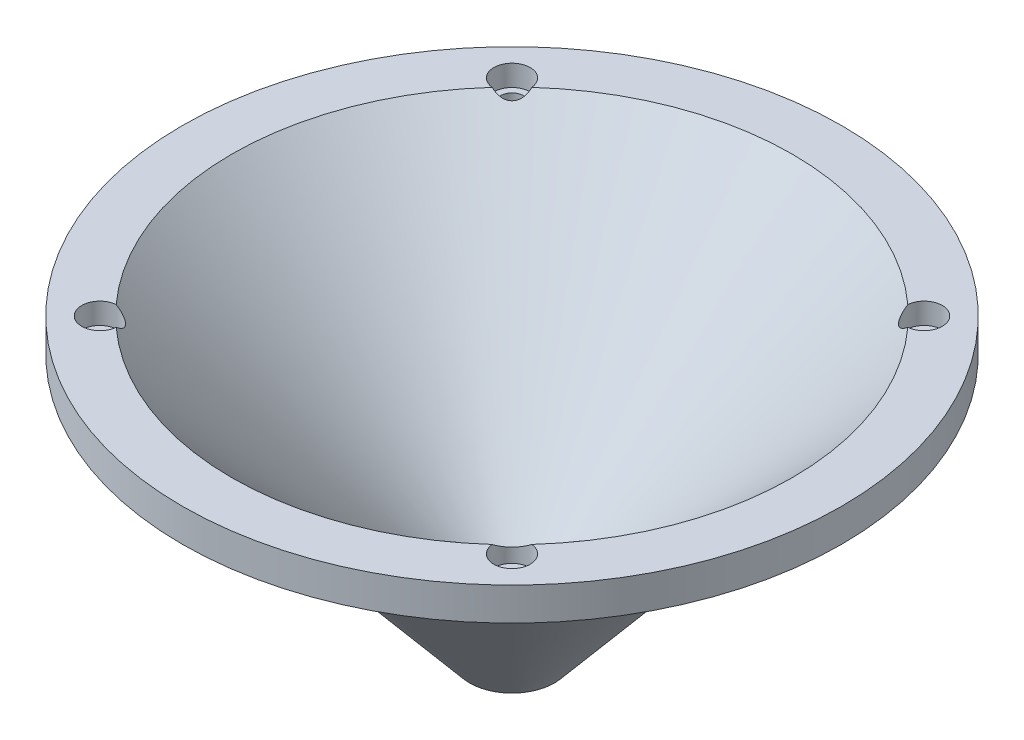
ISO-10303-21;
HEADER;
FILE_DESCRIPTION(('STEP AP214'),'2;1');
FILE_NAME('part.step','',(''),(''),'','','');
FILE_SCHEMA(('AUTOMOTIVE_DESIGN { 1 0 10303 214 1 1 1 1 }'));
ENDSEC;
DATA;
#1=APPLICATION_CONTEXT('core data for automotive mechanical design processes');
#2=APPLICATION_PROTOCOL_DEFINITION('international standard','automotive_design',2000,#1);
#3=PRODUCT_CONTEXT('',#1,'mechanical');
#4=PRODUCT('Part','Part','',(#3));
#5=PRODUCT_RELATED_PRODUCT_CATEGORY('part','',(#4));
#6=PRODUCT_DEFINITION_FORMATION('','',#4);
#7=PRODUCT_DEFINITION_CONTEXT('part definition',#1,'design');
#8=PRODUCT_DEFINITION('design','',#6,#7);
#9=PRODUCT_DEFINITION_SHAPE('','',#8);
#10=(LENGTH_UNIT() NAMED_UNIT(*) SI_UNIT(.MILLI.,.METRE.));
#11=(NAMED_UNIT(*) PLANE_ANGLE_UNIT() SI_UNIT($,.RADIAN.));
#12=(NAMED_UNIT(*) SI_UNIT($,.STERADIAN.) SOLID_ANGLE_UNIT());
#13=UNCERTAINTY_MEASURE_WITH_UNIT(LENGTH_MEASURE(1.E-05),#10,'distance_accuracy_value','');
#14=(GEOMETRIC_REPRESENTATION_CONTEXT(3) GLOBAL_UNCERTAINTY_ASSIGNED_CONTEXT((#13)) GLOBAL_UNIT_ASSIGNED_CONTEXT((#10,
#11,#12)) REPRESENTATION_CONTEXT('',''));
#15=CARTESIAN_POINT('',(0.,0.,0.));
#16=DIRECTION('',(0.,0.,1.));
#17=DIRECTION('',(1.,0.,0.));
#18=AXIS2_PLACEMENT_3D('',#15,#16,#17);
#19=CARTESIAN_POINT('',(0.,-10.,0.));
#20=DIRECTION('',(0.,1.,0.));
#21=DIRECTION('',(0.,0.,1.));
#22=AXIS2_PLACEMENT_3D('',#19,#20,#21);
#23=PLANE('',#22);
#24=CARTESIAN_POINT('',(62.5,-10.,62.5));
#25=DIRECTION('',(0.,1.,0.));
#26=DIRECTION('',(0.,0.,1.));
#27=AXIS2_PLACEMENT_3D('',#24,#25,#26);
#28=CIRCLE('',#27,3.49999999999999);
#29=CARTESIAN_POINT('',(62.5,-10.,66.));
#30=VERTEX_POINT('',#29);
#31=EDGE_CURVE('E165',#30,#30,#28,.T.);
#32=ORIENTED_EDGE('',*,*,#31,.T.);
#33=EDGE_LOOP('',(#32));
#34=FACE_BOUND('',#33,.T.);
#35=CARTESIAN_POINT('',(-62.5,-10.,62.5));
#36=DIRECTION('',(0.,1.,0.));
#37=DIRECTION('',(0.,0.,1.));
#38=AXIS2_PLACEMENT_3D('',#35,#36,#37);
#39=CIRCLE('',#38,3.49999999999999);
#40=CARTESIAN_POINT('',(-62.5,-10.,66.));
#41=VERTEX_POINT('',#40);
#42=EDGE_CURVE('E156',#41,#41,#39,.T.);
#43=ORIENTED_EDGE('',*,*,#42,.T.);
#44=EDGE_LOOP('',(#43));
#45=FACE_BOUND('',#44,.T.);
#46=CARTESIAN_POINT('',(-62.5,-10.,-62.5));
#47=DIRECTION('',(0.,1.,0.));
#48=DIRECTION('',(0.,0.,1.));
#49=AXIS2_PLACEMENT_3D('',#46,#47,#48);
#50=CIRCLE('',#49,3.49999999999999);
#51=CARTESIAN_POINT('',(-62.5,-10.,-59.));
#52=VERTEX_POINT('',#51);
#53=EDGE_CURVE('E173',#52,#52,#50,.T.);
#54=ORIENTED_EDGE('',*,*,#53,.T.);
#55=EDGE_LOOP('',(#54));
#56=FACE_BOUND('',#55,.T.);
#57=CARTESIAN_POINT('',(62.5,-10.,-62.5));
#58=DIRECTION('',(0.,1.,0.));
#59=DIRECTION('',(0.,0.,1.));
#60=AXIS2_PLACEMENT_3D('',#57,#58,#59);
#61=CIRCLE('',#60,3.49999999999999);
#62=CARTESIAN_POINT('',(62.5,-10.,-59.));
#63=VERTEX_POINT('',#62);
#64=EDGE_CURVE('E177',#63,#63,#61,.T.);
#65=ORIENTED_EDGE('',*,*,#64,.T.);
#66=EDGE_LOOP('',(#65));
#67=FACE_BOUND('',#66,.T.);
#68=CARTESIAN_POINT('',(0.,-10.,0.));
#69=DIRECTION('',(0.,1.,0.));
#70=DIRECTION('',(0.,0.,1.));
#71=AXIS2_PLACEMENT_3D('',#68,#69,#70);
#72=CIRCLE('',#71,100.);
#73=CARTESIAN_POINT('',(0.,-10.,100.));
#74=VERTEX_POINT('',#73);
#75=EDGE_CURVE('E184',#74,#74,#72,.T.);
#76=ORIENTED_EDGE('',*,*,#75,.F.);
#77=EDGE_LOOP('',(#76));
#78=FACE_BOUND('',#77,.T.);
#79=CARTESIAN_POINT('',(0.,-9.99999999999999,0.));
#80=DIRECTION('',(0.,1.,0.));
#81=DIRECTION('',(0.,0.,1.));
#82=AXIS2_PLACEMENT_3D('',#79,#80,#81);
#83=CIRCLE('',#82,80.);
#84=CARTESIAN_POINT('',(0.,-10.,79.9999999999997));
#85=VERTEX_POINT('',#84);
#86=EDGE_CURVE('E164',#85,#85,#83,.F.);
#87=ORIENTED_EDGE('',*,*,#86,.F.);
#88=EDGE_LOOP('',(#87));
#89=FACE_BOUND('',#88,.T.);
#90=ADVANCED_FACE('F35',(#34,#45,#56,#67,#78,#89),#23,.F.);
#91=CARTESIAN_POINT('',(0.,-10.,0.));
#92=DIRECTION('',(0.,1.,0.));
#93=DIRECTION('',(0.,0.,1.));
#94=AXIS2_PLACEMENT_3D('',#91,#92,#93);
#95=CYLINDRICAL_SURFACE('',#94,100.);
#96=ORIENTED_EDGE('',*,*,#75,.T.);
#97=EDGE_LOOP('',(#96));
#98=FACE_BOUND('',#97,.T.);
#99=CARTESIAN_POINT('',(0.,0.,0.));
#100=DIRECTION('',(0.,1.,0.));
#101=DIRECTION('',(0.,0.,1.));
#102=AXIS2_PLACEMENT_3D('',#99,#100,#101);
#103=CIRCLE('',#102,100.);
#104=CARTESIAN_POINT('',(0.,0.,100.));
#105=VERTEX_POINT('',#104);
#106=EDGE_CURVE('E185',#105,#105,#103,.T.);
#107=ORIENTED_EDGE('',*,*,#106,.F.);
#108=EDGE_LOOP('',(#107));
#109=FACE_BOUND('',#108,.T.);
#110=ADVANCED_FACE('F220',(#98,#109),#95,.T.);
#111=CARTESIAN_POINT('',(0.,0.,0.));
#112=DIRECTION('',(0.,1.,0.));
#113=DIRECTION('',(0.,0.,1.));
#114=AXIS2_PLACEMENT_3D('',#111,#112,#113);
#115=PLANE('',#114);
#116=CARTESIAN_POINT('',(-62.5,0.,-62.5));
#117=DIRECTION('',(0.,1.,0.));
#118=DIRECTION('',(0.,0.,1.));
#119=AXIS2_PLACEMENT_3D('',#116,#117,#118);
#120=CIRCLE('',#119,5.49999999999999);
#121=CARTESIAN_POINT('',(-57.0258085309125,0.,-63.0321914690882));
#122=VERTEX_POINT('',#121);
#123=CARTESIAN_POINT('',(-63.0321914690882,0.,-57.0258085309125));
#124=VERTEX_POINT('',#123);
#125=EDGE_CURVE('E151',#122,#124,#120,.T.);
#126=ORIENTED_EDGE('',*,*,#125,.F.);
#127=CARTESIAN_POINT('',(0.,0.,0.));
#128=DIRECTION('',(0.,1.,0.));
#129=DIRECTION('',(0.,0.,1.));
#130=AXIS2_PLACEMENT_3D('',#127,#128,#129);
#131=CIRCLE('',#130,85.0000000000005);
#132=CARTESIAN_POINT('',(57.0258085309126,0.,-63.0321914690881));
#133=VERTEX_POINT('',#132);
#134=EDGE_CURVE('E84',#122,#133,#131,.F.);
#135=ORIENTED_EDGE('',*,*,#134,.T.);
#136=CARTESIAN_POINT('',(62.5,0.,-62.5));
#137=DIRECTION('',(0.,1.,0.));
#138=DIRECTION('',(0.,0.,1.));
#139=AXIS2_PLACEMENT_3D('',#136,#137,#138);
#140=CIRCLE('',#139,5.49999999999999);
#141=CARTESIAN_POINT('',(63.0321914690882,0.,-57.0258085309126));
#142=VERTEX_POINT('',#141);
#143=EDGE_CURVE('E82',#142,#133,#140,.T.);
#144=ORIENTED_EDGE('',*,*,#143,.F.);
#145=CARTESIAN_POINT('',(0.,0.,0.));
#146=DIRECTION('',(0.,1.,0.));
#147=DIRECTION('',(0.,0.,1.));
#148=AXIS2_PLACEMENT_3D('',#145,#146,#147);
#149=CIRCLE('',#148,85.0000000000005);
#150=CARTESIAN_POINT('',(63.0321914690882,0.,57.0258085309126));
#151=VERTEX_POINT('',#150);
#152=EDGE_CURVE('E75',#142,#151,#149,.F.);
#153=ORIENTED_EDGE('',*,*,#152,.T.);
#154=CARTESIAN_POINT('',(62.5,0.,62.5));
#155=DIRECTION('',(0.,1.,0.));
#156=DIRECTION('',(0.,0.,1.));
#157=AXIS2_PLACEMENT_3D('',#154,#155,#156);
#158=CIRCLE('',#157,5.49999999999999);
#159=CARTESIAN_POINT('',(57.0258085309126,0.,63.0321914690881));
#160=VERTEX_POINT('',#159);
#161=EDGE_CURVE('E80',#160,#151,#158,.T.);
#162=ORIENTED_EDGE('',*,*,#161,.F.);
#163=CARTESIAN_POINT('',(0.,0.,0.));
#164=DIRECTION('',(0.,1.,0.));
#165=DIRECTION('',(0.,0.,1.));
#166=AXIS2_PLACEMENT_3D('',#163,#164,#165);
#167=CIRCLE('',#166,85.0000000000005);
#168=CARTESIAN_POINT('',(-57.0258085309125,0.,63.0321914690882));
#169=VERTEX_POINT('',#168);
#170=EDGE_CURVE('E85',#160,#169,#167,.F.);
#171=ORIENTED_EDGE('',*,*,#170,.T.);
#172=CARTESIAN_POINT('',(-62.5,0.,62.5));
#173=DIRECTION('',(0.,1.,0.));
#174=DIRECTION('',(0.,0.,1.));
#175=AXIS2_PLACEMENT_3D('',#172,#173,#174);
#176=CIRCLE('',#175,5.49999999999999);
#177=CARTESIAN_POINT('',(-63.0321914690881,0.,57.0258085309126));
#178=VERTEX_POINT('',#177);
#179=EDGE_CURVE('E168',#178,#169,#176,.T.);
#180=ORIENTED_EDGE('',*,*,#179,.F.);
#181=CARTESIAN_POINT('',(0.,0.,0.));
#182=DIRECTION('',(0.,1.,0.));
#183=DIRECTION('',(0.,0.,1.));
#184=AXIS2_PLACEMENT_3D('',#181,#182,#183);
#185=CIRCLE('',#184,85.0000000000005);
#186=EDGE_CURVE('E154',#178,#124,#185,.F.);
#187=ORIENTED_EDGE('',*,*,#186,.T.);
#188=EDGE_LOOP('',(#126,#135,#144,#153,#162,#171,#180,#187));
#189=FACE_BOUND('',#188,.T.);
#190=ORIENTED_EDGE('',*,*,#106,.T.);
#191=EDGE_LOOP('',(#190));
#192=FACE_BOUND('',#191,.T.);
#193=ADVANCED_FACE('F78',(#189,#192),#115,.T.);
#194=CARTESIAN_POINT('',(0.,-90.,0.));
#195=DIRECTION('',(0.,-1.,0.));
#196=DIRECTION('',(0.,0.,-1.));
#197=AXIS2_PLACEMENT_3D('',#194,#195,#196);
#198=PLANE('',#197);
#199=CARTESIAN_POINT('',(0.,-90.,0.));
#200=DIRECTION('',(0.,-1.,0.));
#201=DIRECTION('',(0.,0.,-1.));
#202=AXIS2_PLACEMENT_3D('',#199,#200,#201);
#203=CIRCLE('',#202,12.8720295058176);
#204=CARTESIAN_POINT('',(0.,-90.,12.8720295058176));
#205=VERTEX_POINT('',#204);
#206=EDGE_CURVE('E11',#205,#205,#203,.T.);
#207=ORIENTED_EDGE('',*,*,#206,.T.);
#208=EDGE_LOOP('',(#207));
#209=FACE_BOUND('',#208,.T.);
#210=CARTESIAN_POINT('',(0.,-90.,0.));
#211=DIRECTION('',(0.,1.,0.));
#212=DIRECTION('',(0.,0.,1.));
#213=AXIS2_PLACEMENT_3D('',#210,#211,#212);
#214=CIRCLE('',#213,5.);
#215=CARTESIAN_POINT('',(0.,-90.,5.));
#216=VERTEX_POINT('',#215);
#217=EDGE_CURVE('E180',#216,#216,#214,.T.);
#218=ORIENTED_EDGE('',*,*,#217,.T.);
#219=EDGE_LOOP('',(#218));
#220=FACE_BOUND('',#219,.T.);
#221=ADVANCED_FACE('F236',(#209,#220),#198,.T.);
#222=CARTESIAN_POINT('',(0.,-90.,0.));
#223=DIRECTION('',(0.,1.,0.));
#224=DIRECTION('',(0.,0.,1.));
#225=AXIS2_PLACEMENT_3D('',#222,#223,#224);
#226=CYLINDRICAL_SURFACE('',#225,5.);
#227=CARTESIAN_POINT('',(0.,-80.0000000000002,0.));
#228=DIRECTION('',(0.,1.,0.));
#229=DIRECTION('',(0.,0.,1.));
#230=AXIS2_PLACEMENT_3D('',#227,#228,#229);
#231=CIRCLE('',#230,5.);
#232=CARTESIAN_POINT('',(0.,-80.0000000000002,5.));
#233=VERTEX_POINT('',#232);
#234=EDGE_CURVE('E161',#233,#233,#231,.T.);
#235=CARTESIAN_POINT('',(0.,-80.0000000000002,5.));
#236=CARTESIAN_POINT('',(0.,-80.1041666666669,5.));
#237=CARTESIAN_POINT('',(0.,-80.2083333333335,5.));
#238=CARTESIAN_POINT('',(0.,-80.4166666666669,5.));
#239=CARTESIAN_POINT('',(0.,-80.5208333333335,5.));
#240=CARTESIAN_POINT('',(0.,-80.7291666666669,5.));
#241=CARTESIAN_POINT('',(0.,-80.8333333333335,5.));
#242=CARTESIAN_POINT('',(0.,-81.0416666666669,5.));
#243=CARTESIAN_POINT('',(0.,-81.1458333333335,5.));
#244=CARTESIAN_POINT('',(0.,-81.3541666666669,5.));
#245=CARTESIAN_POINT('',(0.,-81.4583333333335,5.));
#246=CARTESIAN_POINT('',(0.,-81.6666666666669,5.));
#247=CARTESIAN_POINT('',(0.,-81.7708333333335,5.));
#248=CARTESIAN_POINT('',(0.,-81.9791666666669,5.));
#249=CARTESIAN_POINT('',(0.,-82.0833333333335,5.));
#250=CARTESIAN_POINT('',(0.,-82.2916666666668,5.));
#251=CARTESIAN_POINT('',(0.,-82.3958333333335,5.));
#252=CARTESIAN_POINT('',(0.,-82.6041666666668,5.));
#253=CARTESIAN_POINT('',(0.,-82.7083333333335,5.));
#254=CARTESIAN_POINT('',(0.,-82.9166666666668,5.));
#255=CARTESIAN_POINT('',(0.,-83.0208333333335,5.));
#256=CARTESIAN_POINT('',(0.,-83.2291666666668,5.));
#257=CARTESIAN_POINT('',(0.,-83.3333333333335,5.));
#258=CARTESIAN_POINT('',(0.,-83.5416666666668,5.));
#259=CARTESIAN_POINT('',(0.,-83.6458333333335,5.));
#260=CARTESIAN_POINT('',(0.,-83.8541666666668,5.));
#261=CARTESIAN_POINT('',(0.,-83.9583333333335,5.));
#262=CARTESIAN_POINT('',(0.,-84.1666666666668,5.));
#263=CARTESIAN_POINT('',(0.,-84.2708333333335,5.));
#264=CARTESIAN_POINT('',(0.,-84.4791666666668,5.));
#265=CARTESIAN_POINT('',(0.,-84.5833333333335,5.));
#266=CARTESIAN_POINT('',(0.,-84.7916666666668,5.));
#267=CARTESIAN_POINT('',(0.,-84.8958333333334,5.));
#268=CARTESIAN_POINT('',(0.,-85.1041666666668,5.));
#269=CARTESIAN_POINT('',(0.,-85.2083333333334,5.));
#270=CARTESIAN_POINT('',(0.,-85.4166666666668,5.));
#271=CARTESIAN_POINT('',(0.,-85.5208333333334,5.));
#272=CARTESIAN_POINT('',(0.,-85.7291666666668,5.));
#273=CARTESIAN_POINT('',(0.,-85.8333333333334,5.));
#274=CARTESIAN_POINT('',(0.,-86.0416666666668,5.));
#275=CARTESIAN_POINT('',(0.,-86.1458333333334,5.));
#276=CARTESIAN_POINT('',(0.,-86.3541666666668,5.));
#277=CARTESIAN_POINT('',(0.,-86.4583333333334,5.));
#278=CARTESIAN_POINT('',(0.,-86.6666666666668,5.));
#279=CARTESIAN_POINT('',(0.,-86.7708333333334,5.));
#280=CARTESIAN_POINT('',(0.,-86.9791666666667,5.));
#281=CARTESIAN_POINT('',(0.,-87.0833333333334,5.));
#282=CARTESIAN_POINT('',(0.,-87.2916666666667,5.));
#283=CARTESIAN_POINT('',(0.,-87.3958333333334,5.));
#284=CARTESIAN_POINT('',(0.,-87.6041666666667,5.));
#285=CARTESIAN_POINT('',(0.,-87.7083333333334,5.));
#286=CARTESIAN_POINT('',(0.,-87.9166666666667,5.));
#287=CARTESIAN_POINT('',(0.,-88.0208333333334,5.));
#288=CARTESIAN_POINT('',(0.,-88.2291666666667,5.));
#289=CARTESIAN_POINT('',(0.,-88.3333333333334,5.));
#290=CARTESIAN_POINT('',(0.,-88.5416666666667,5.));
#291=CARTESIAN_POINT('',(0.,-88.6458333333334,5.));
#292=CARTESIAN_POINT('',(0.,-88.8541666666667,5.));
#293=CARTESIAN_POINT('',(0.,-88.9583333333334,5.));
#294=CARTESIAN_POINT('',(0.,-89.1666666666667,5.));
#295=CARTESIAN_POINT('',(0.,-89.2708333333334,5.));
#296=CARTESIAN_POINT('',(0.,-89.4791666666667,5.));
#297=CARTESIAN_POINT('',(0.,-89.5833333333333,5.));
#298=CARTESIAN_POINT('',(0.,-89.7916666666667,5.));
#299=CARTESIAN_POINT('',(0.,-89.8958333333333,5.));
#300=CARTESIAN_POINT('',(0.,-90.,5.));
#301=B_SPLINE_CURVE_WITH_KNOTS('',3,(#235,#236,#237,#238,#239,#240,#241,#242,#243,#244,#245,
#246,#247,#248,#249,#250,#251,#252,#253,#254,#255,#256,#257,#258,#259,#260,#261,#262,#263,#264,
#265,#266,#267,#268,#269,#270,#271,#272,#273,#274,#275,#276,#277,#278,#279,#280,#281,#282,#283,
#284,#285,#286,#287,#288,#289,#290,#291,#292,#293,#294,#295,#296,#297,#298,#299,#300),
.UNSPECIFIED.,.F.,.F.,(4,2,2,2,2,2,2,2,2,2,2,2,2,2,2,2,2,2,2,2,2,2,2,2,2,2,2,2,2,2,2,2,4),(0.,
0.312499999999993,0.624999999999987,0.93749999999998,1.24999999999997,1.56249999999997,
1.87499999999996,2.18749999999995,2.49999999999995,2.81249999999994,3.12499999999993,
3.43749999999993,3.74999999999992,4.06249999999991,4.37499999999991,4.6874999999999,
4.99999999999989,5.31249999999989,5.62499999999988,5.93749999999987,6.24999999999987,
6.56249999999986,6.87499999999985,7.18749999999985,7.49999999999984,7.81249999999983,
8.12499999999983,8.43749999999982,8.74999999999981,9.06249999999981,9.3749999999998,
9.68749999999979,9.99999999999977),.UNSPECIFIED.);
#302=EDGE_CURVE('BSEAM239',#233,#216,#301,.T.);
#303=ORIENTED_EDGE('',*,*,#234,.T.);
#304=ORIENTED_EDGE('',*,*,#217,.F.);
#305=ORIENTED_EDGE('',*,*,#302,.T.);
#306=ORIENTED_EDGE('',*,*,#302,.F.);
#307=EDGE_LOOP('',(#303,#305,#304,#306));
#308=FACE_BOUND('',#307,.T.);
#309=ADVANCED_FACE('F239',(#308),#226,.F.);
#310=CARTESIAN_POINT('',(62.5,0.,-62.5));
#311=DIRECTION('',(0.,1.,0.));
#312=DIRECTION('',(0.,0.,1.));
#313=AXIS2_PLACEMENT_3D('',#310,#311,#312);
#314=CYLINDRICAL_SURFACE('',#313,3.49999999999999);
#315=CARTESIAN_POINT('',(62.5,-6.4,-62.5));
#316=DIRECTION('',(0.,1.,0.));
#317=DIRECTION('',(0.,0.,1.));
#318=AXIS2_PLACEMENT_3D('',#315,#316,#317);
#319=CIRCLE('',#318,3.5);
#320=CARTESIAN_POINT('',(62.5,-6.4,-59.));
#321=VERTEX_POINT('',#320);
#322=EDGE_CURVE('E181',#321,#321,#319,.T.);
#323=ORIENTED_EDGE('',*,*,#322,.T.);
#324=EDGE_LOOP('',(#323));
#325=FACE_BOUND('',#324,.T.);
#326=ORIENTED_EDGE('',*,*,#64,.F.);
#327=EDGE_LOOP('',(#326));
#328=FACE_BOUND('',#327,.T.);
#329=ADVANCED_FACE('F244',(#325,#328),#314,.F.);
#330=CARTESIAN_POINT('',(66.,-6.4,-62.5));
#331=DIRECTION('',(0.,-1.,0.));
#332=DIRECTION('',(0.,0.,-1.));
#333=AXIS2_PLACEMENT_3D('',#330,#331,#332);
#334=PLANE('',#333);
#335=ORIENTED_EDGE('',*,*,#322,.F.);
#336=EDGE_LOOP('',(#335));
#337=FACE_BOUND('',#336,.T.);
#338=CARTESIAN_POINT('',(62.5,-6.4,-62.5));
#339=DIRECTION('',(0.,1.,0.));
#340=DIRECTION('',(0.,0.,1.));
#341=AXIS2_PLACEMENT_3D('',#338,#339,#340);
#342=CIRCLE('',#341,5.49999999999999);
#343=CARTESIAN_POINT('',(62.5,-6.4,-57.));
#344=VERTEX_POINT('',#343);
#345=EDGE_CURVE('E194',#344,#344,#342,.T.);
#346=ORIENTED_EDGE('',*,*,#345,.T.);
#347=EDGE_LOOP('',(#346));
#348=FACE_BOUND('',#347,.T.);
#349=ADVANCED_FACE('F250',(#337,#348),#334,.F.);
#350=CARTESIAN_POINT('',(62.5,0.,-62.5));
#351=DIRECTION('',(0.,1.,0.));
#352=DIRECTION('',(0.,0.,1.));
#353=AXIS2_PLACEMENT_3D('',#350,#351,#352);
#354=CYLINDRICAL_SURFACE('',#353,5.49999999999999);
#355=ORIENTED_EDGE('',*,*,#345,.F.);
#356=EDGE_LOOP('',(#355));
#357=FACE_BOUND('',#356,.T.);
#358=ORIENTED_EDGE('',*,*,#143,.T.);
#359=CARTESIAN_POINT('',(57.0258085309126,0.,-63.0321914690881));
#360=CARTESIAN_POINT('',(57.0122348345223,-0.112777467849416,-62.8923846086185));
#361=CARTESIAN_POINT('',(57.0038218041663,-0.223593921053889,-62.7503957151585));
#362=CARTESIAN_POINT('',(56.9982324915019,-0.440471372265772,-62.4621851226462));
#363=CARTESIAN_POINT('',(57.001078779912,-0.546522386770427,-62.3159555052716));
#364=CARTESIAN_POINT('',(57.0190879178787,-0.753754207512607,-62.0182644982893));
#365=CARTESIAN_POINT('',(57.034391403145,-0.854865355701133,-61.8667623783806));
#366=CARTESIAN_POINT('',(57.0785487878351,-1.04940050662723,-61.5610007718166));
#367=CARTESIAN_POINT('',(57.1073914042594,-1.14283083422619,-61.4067436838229));
#368=CARTESIAN_POINT('',(57.1958764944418,-1.36003393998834,-61.0271435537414));
#369=CARTESIAN_POINT('',(57.2635114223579,-1.47882731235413,-60.8006892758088));
#370=CARTESIAN_POINT('',(57.4323000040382,-1.69067818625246,-60.3491548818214));
#371=CARTESIAN_POINT('',(57.5333092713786,-1.78384343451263,-60.1240730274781));
#372=CARTESIAN_POINT('',(57.7521645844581,-1.9264257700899,-59.7155508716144));
#373=CARTESIAN_POINT('',(57.8650168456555,-1.98037225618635,-59.5310389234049));
#374=CARTESIAN_POINT('',(58.1150957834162,-2.06183752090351,-59.1728009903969));
#375=CARTESIAN_POINT('',(58.2523227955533,-2.08935593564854,-58.9990751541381));
#376=CARTESIAN_POINT('',(58.54847580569,-2.11575237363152,-58.6679106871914));
#377=CARTESIAN_POINT('',(58.7074564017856,-2.11455696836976,-58.5105148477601));
#378=CARTESIAN_POINT('',(59.0417606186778,-2.08344725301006,-58.2174753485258));
#379=CARTESIAN_POINT('',(59.2170859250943,-2.05352997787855,-58.0818339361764));
#380=CARTESIAN_POINT('',(59.5709750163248,-1.96909057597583,-57.8400670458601));
#381=CARTESIAN_POINT('',(59.7491390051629,-1.91558437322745,-57.7329891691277));
#382=CARTESIAN_POINT('',(60.1102173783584,-1.78765447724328,-57.5421055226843));
#383=CARTESIAN_POINT('',(60.2931332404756,-1.71322420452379,-57.4583070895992));
#384=CARTESIAN_POINT('',(60.7421572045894,-1.50978464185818,-57.2806563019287));
#385=CARTESIAN_POINT('',(61.0088245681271,-1.37126224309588,-57.199117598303));
#386=CARTESIAN_POINT('',(61.5369084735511,-1.06754000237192,-57.0781693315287));
#387=CARTESIAN_POINT('',(61.7983064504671,-0.902259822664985,-57.038889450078));
#388=CARTESIAN_POINT('',(62.2228755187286,-0.612965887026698,-57.0043910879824));
#389=CARTESIAN_POINT('',(62.3889760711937,-0.49425093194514,-56.9986788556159));
#390=CARTESIAN_POINT('',(62.7150006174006,-0.251156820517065,-57.0018124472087));
#391=CARTESIAN_POINT('',(62.8749605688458,-0.126824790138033,-57.0105533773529));
#392=CARTESIAN_POINT('',(63.0321914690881,0.,-57.0258085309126));
#393=B_SPLINE_CURVE_WITH_KNOTS('',3,(#359,#360,#361,#362,#363,#364,#365,#366,#367,#368,#369,
#370,#371,#372,#373,#374,#375,#376,#377,#378,#379,#380,#381,#382,#383,#384,#385,#386,#387,#388,
#389,#390,#391,#392),.UNSPECIFIED.,.F.,.F.,(4,2,2,2,2,2,2,2,2,2,2,2,2,2,2,2,4),(0.,
0.540422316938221,1.08192852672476,1.62963428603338,2.17688441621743,2.9674561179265,
3.75465142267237,4.42053026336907,5.08641827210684,5.75400930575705,6.42166926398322,
7.06302216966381,7.70457697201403,8.63353971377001,9.56534514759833,10.1774362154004,
10.7851045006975),.UNSPECIFIED.);
#394=EDGE_CURVE('E50',#133,#142,#393,.T.);
#395=ORIENTED_EDGE('',*,*,#394,.T.);
#396=EDGE_LOOP('',(#358,#395));
#397=FACE_BOUND('',#396,.T.);
#398=ADVANCED_FACE('F329',(#357,#397),#354,.F.);
#399=CARTESIAN_POINT('',(-62.5,0.,-62.5));
#400=DIRECTION('',(0.,1.,0.));
#401=DIRECTION('',(0.,0.,1.));
#402=AXIS2_PLACEMENT_3D('',#399,#400,#401);
#403=CYLINDRICAL_SURFACE('',#402,3.49999999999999);
#404=CARTESIAN_POINT('',(-62.5,-6.4,-62.5));
#405=DIRECTION('',(0.,1.,0.));
#406=DIRECTION('',(0.,0.,1.));
#407=AXIS2_PLACEMENT_3D('',#404,#405,#406);
#408=CIRCLE('',#407,3.5);
#409=CARTESIAN_POINT('',(-62.5,-6.4,-59.));
#410=VERTEX_POINT('',#409);
#411=EDGE_CURVE('E176',#410,#410,#408,.T.);
#412=ORIENTED_EDGE('',*,*,#411,.T.);
#413=EDGE_LOOP('',(#412));
#414=FACE_BOUND('',#413,.T.);
#415=ORIENTED_EDGE('',*,*,#53,.F.);
#416=EDGE_LOOP('',(#415));
#417=FACE_BOUND('',#416,.T.);
#418=ADVANCED_FACE('F322',(#414,#417),#403,.F.);
#419=CARTESIAN_POINT('',(-59.,-6.4,-62.5));
#420=DIRECTION('',(0.,-1.,0.));
#421=DIRECTION('',(0.,0.,-1.));
#422=AXIS2_PLACEMENT_3D('',#419,#420,#421);
#423=PLANE('',#422);
#424=ORIENTED_EDGE('',*,*,#411,.F.);
#425=EDGE_LOOP('',(#424));
#426=FACE_BOUND('',#425,.T.);
#427=CARTESIAN_POINT('',(-62.5,-6.4,-62.5));
#428=DIRECTION('',(0.,1.,0.));
#429=DIRECTION('',(0.,0.,1.));
#430=AXIS2_PLACEMENT_3D('',#427,#428,#429);
#431=CIRCLE('',#430,5.5);
#432=CARTESIAN_POINT('',(-62.5,-6.4,-57.));
#433=VERTEX_POINT('',#432);
#434=EDGE_CURVE('E155',#433,#433,#431,.T.);
#435=ORIENTED_EDGE('',*,*,#434,.T.);
#436=EDGE_LOOP('',(#435));
#437=FACE_BOUND('',#436,.T.);
#438=ADVANCED_FACE('F142',(#426,#437),#423,.F.);
#439=CARTESIAN_POINT('',(-62.5,0.,-62.5));
#440=DIRECTION('',(0.,1.,0.));
#441=DIRECTION('',(0.,0.,1.));
#442=AXIS2_PLACEMENT_3D('',#439,#440,#441);
#443=CYLINDRICAL_SURFACE('',#442,5.49999999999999);
#444=ORIENTED_EDGE('',*,*,#434,.F.);
#445=EDGE_LOOP('',(#444));
#446=FACE_BOUND('',#445,.T.);
#447=ORIENTED_EDGE('',*,*,#125,.T.);
#448=CARTESIAN_POINT('',(-63.0321914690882,0.,-57.0258085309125));
#449=CARTESIAN_POINT('',(-62.8923846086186,-0.112777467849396,-57.0122348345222));
#450=CARTESIAN_POINT('',(-62.7503957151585,-0.223593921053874,-57.0038218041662));
#451=CARTESIAN_POINT('',(-62.4621851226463,-0.44047137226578,-56.9982324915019));
#452=CARTESIAN_POINT('',(-62.3159555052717,-0.546522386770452,-57.001078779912));
#453=CARTESIAN_POINT('',(-62.0182644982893,-0.753754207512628,-57.0190879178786));
#454=CARTESIAN_POINT('',(-61.8667623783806,-0.854865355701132,-57.0343914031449));
#455=CARTESIAN_POINT('',(-61.5610007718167,-1.04940050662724,-57.0785487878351));
#456=CARTESIAN_POINT('',(-61.406743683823,-1.14283083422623,-57.1073914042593));
#457=CARTESIAN_POINT('',(-61.0271435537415,-1.3600339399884,-57.1958764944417));
#458=CARTESIAN_POINT('',(-60.8006892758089,-1.47882731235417,-57.2635114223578));
#459=CARTESIAN_POINT('',(-60.3491548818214,-1.6906781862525,-57.4323000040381));
#460=CARTESIAN_POINT('',(-60.1240730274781,-1.78384343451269,-57.5333092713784));
#461=CARTESIAN_POINT('',(-59.7155508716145,-1.92642577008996,-57.752164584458));
#462=CARTESIAN_POINT('',(-59.5310389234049,-1.9803722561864,-57.8650168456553));
#463=CARTESIAN_POINT('',(-59.1728009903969,-2.06183752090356,-58.1150957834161));
#464=CARTESIAN_POINT('',(-58.9990751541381,-2.0893559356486,-58.2523227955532));
#465=CARTESIAN_POINT('',(-58.6679106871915,-2.1157523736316,-58.5484758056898));
#466=CARTESIAN_POINT('',(-58.5105148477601,-2.11455696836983,-58.7074564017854));
#467=CARTESIAN_POINT('',(-58.2174753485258,-2.08344725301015,-59.0417606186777));
#468=CARTESIAN_POINT('',(-58.0818339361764,-2.05352997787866,-59.2170859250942));
#469=CARTESIAN_POINT('',(-57.8400670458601,-1.96909057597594,-59.5709750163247));
#470=CARTESIAN_POINT('',(-57.7329891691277,-1.91558437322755,-59.7491390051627));
#471=CARTESIAN_POINT('',(-57.5421055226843,-1.78765447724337,-60.1102173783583));
#472=CARTESIAN_POINT('',(-57.4583070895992,-1.71322420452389,-60.2931332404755));
#473=CARTESIAN_POINT('',(-57.2806563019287,-1.50978464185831,-60.7421572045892));
#474=CARTESIAN_POINT('',(-57.199117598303,-1.37126224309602,-61.0088245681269));
#475=CARTESIAN_POINT('',(-57.0781693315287,-1.06754000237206,-61.5369084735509));
#476=CARTESIAN_POINT('',(-57.038889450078,-0.902259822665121,-61.7983064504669));
#477=CARTESIAN_POINT('',(-57.0043910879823,-0.612965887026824,-62.2228755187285));
#478=CARTESIAN_POINT('',(-56.9986788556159,-0.494250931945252,-62.3889760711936));
#479=CARTESIAN_POINT('',(-57.0018124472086,-0.251156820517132,-62.7150006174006));
#480=CARTESIAN_POINT('',(-57.0105533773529,-0.12682479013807,-62.8749605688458));
#481=CARTESIAN_POINT('',(-57.0258085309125,0.,-63.0321914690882));
#482=B_SPLINE_CURVE_WITH_KNOTS('',3,(#448,#449,#450,#451,#452,#453,#454,#455,#456,#457,#458,
#459,#460,#461,#462,#463,#464,#465,#466,#467,#468,#469,#470,#471,#472,#473,#474,#475,#476,#477,
#478,#479,#480,#481),.UNSPECIFIED.,.F.,.F.,(4,2,2,2,2,2,2,2,2,2,2,2,2,2,2,2,4),(0.,
0.540422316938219,1.08192852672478,1.6296342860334,2.17688441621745,2.96745611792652,
3.7546514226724,4.42053026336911,5.08641827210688,5.75400930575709,6.42166926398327,
7.06302216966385,7.70457697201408,8.63353971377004,9.56534514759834,10.1774362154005,
10.7851045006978),.UNSPECIFIED.);
#483=EDGE_CURVE('E43',#124,#122,#482,.T.);
#484=ORIENTED_EDGE('',*,*,#483,.T.);
#485=EDGE_LOOP('',(#447,#484));
#486=FACE_BOUND('',#485,.T.);
#487=ADVANCED_FACE('F137',(#446,#486),#443,.F.);
#488=CARTESIAN_POINT('',(-62.5,0.,62.5));
#489=DIRECTION('',(0.,1.,0.));
#490=DIRECTION('',(0.,0.,1.));
#491=AXIS2_PLACEMENT_3D('',#488,#489,#490);
#492=CYLINDRICAL_SURFACE('',#491,3.49999999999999);
#493=CARTESIAN_POINT('',(-62.5,-6.4,62.5));
#494=DIRECTION('',(0.,1.,0.));
#495=DIRECTION('',(0.,0.,1.));
#496=AXIS2_PLACEMENT_3D('',#493,#494,#495);
#497=CIRCLE('',#496,3.5);
#498=CARTESIAN_POINT('',(-62.5,-6.4,66.));
#499=VERTEX_POINT('',#498);
#500=EDGE_CURVE('E172',#499,#499,#497,.T.);
#501=ORIENTED_EDGE('',*,*,#500,.T.);
#502=EDGE_LOOP('',(#501));
#503=FACE_BOUND('',#502,.T.);
#504=ORIENTED_EDGE('',*,*,#42,.F.);
#505=EDGE_LOOP('',(#504));
#506=FACE_BOUND('',#505,.T.);
#507=ADVANCED_FACE('F133',(#503,#506),#492,.F.);
#508=CARTESIAN_POINT('',(-59.,-6.4,62.5));
#509=DIRECTION('',(0.,-1.,0.));
#510=DIRECTION('',(0.,0.,-1.));
#511=AXIS2_PLACEMENT_3D('',#508,#509,#510);
#512=PLANE('',#511);
#513=ORIENTED_EDGE('',*,*,#500,.F.);
#514=EDGE_LOOP('',(#513));
#515=FACE_BOUND('',#514,.T.);
#516=CARTESIAN_POINT('',(-62.5,-6.4,62.5));
#517=DIRECTION('',(0.,1.,0.));
#518=DIRECTION('',(0.,0.,1.));
#519=AXIS2_PLACEMENT_3D('',#516,#517,#518);
#520=CIRCLE('',#519,5.5);
#521=CARTESIAN_POINT('',(-62.5,-6.4,68.));
#522=VERTEX_POINT('',#521);
#523=EDGE_CURVE('E204',#522,#522,#520,.T.);
#524=ORIENTED_EDGE('',*,*,#523,.T.);
#525=EDGE_LOOP('',(#524));
#526=FACE_BOUND('',#525,.T.);
#527=ADVANCED_FACE('F129',(#515,#526),#512,.F.);
#528=CARTESIAN_POINT('',(-62.5,0.,62.5));
#529=DIRECTION('',(0.,1.,0.));
#530=DIRECTION('',(0.,0.,1.));
#531=AXIS2_PLACEMENT_3D('',#528,#529,#530);
#532=CYLINDRICAL_SURFACE('',#531,5.49999999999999);
#533=ORIENTED_EDGE('',*,*,#523,.F.);
#534=EDGE_LOOP('',(#533));
#535=FACE_BOUND('',#534,.T.);
#536=ORIENTED_EDGE('',*,*,#179,.T.);
#537=CARTESIAN_POINT('',(-57.0258085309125,0.,63.0321914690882));
#538=CARTESIAN_POINT('',(-57.0122348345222,-0.112777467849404,62.8923846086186));
#539=CARTESIAN_POINT('',(-57.0038218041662,-0.223593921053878,62.7503957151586));
#540=CARTESIAN_POINT('',(-56.9982324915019,-0.44047137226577,62.4621851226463));
#541=CARTESIAN_POINT('',(-57.0010787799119,-0.546522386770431,62.3159555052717));
#542=CARTESIAN_POINT('',(-57.0190879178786,-0.753754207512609,62.0182644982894));
#543=CARTESIAN_POINT('',(-57.0343914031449,-0.854865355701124,61.8667623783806));
#544=CARTESIAN_POINT('',(-57.0785487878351,-1.04940050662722,61.5610007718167));
#545=CARTESIAN_POINT('',(-57.1073914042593,-1.1428308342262,61.406743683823));
#546=CARTESIAN_POINT('',(-57.1958764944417,-1.36003393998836,61.0271435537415));
#547=CARTESIAN_POINT('',(-57.2635114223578,-1.47882731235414,60.8006892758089));
#548=CARTESIAN_POINT('',(-57.4323000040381,-1.69067818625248,60.3491548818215));
#549=CARTESIAN_POINT('',(-57.5333092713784,-1.78384343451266,60.1240730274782));
#550=CARTESIAN_POINT('',(-57.752164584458,-1.92642577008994,59.7155508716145));
#551=CARTESIAN_POINT('',(-57.8650168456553,-1.98037225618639,59.5310389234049));
#552=CARTESIAN_POINT('',(-58.1150957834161,-2.06183752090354,59.1728009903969));
#553=CARTESIAN_POINT('',(-58.2523227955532,-2.08935593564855,58.9990751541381));
#554=CARTESIAN_POINT('',(-58.5484758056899,-2.11575237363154,58.6679106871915));
#555=CARTESIAN_POINT('',(-58.7074564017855,-2.11455696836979,58.5105148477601));
#556=CARTESIAN_POINT('',(-59.0417606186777,-2.08344725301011,58.2174753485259));
#557=CARTESIAN_POINT('',(-59.2170859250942,-2.0535299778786,58.0818339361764));
#558=CARTESIAN_POINT('',(-59.5709750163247,-1.96909057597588,57.8400670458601));
#559=CARTESIAN_POINT('',(-59.7491390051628,-1.91558437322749,57.7329891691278));
#560=CARTESIAN_POINT('',(-60.1102173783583,-1.78765447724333,57.5421055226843));
#561=CARTESIAN_POINT('',(-60.2931332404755,-1.71322420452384,57.4583070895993));
#562=CARTESIAN_POINT('',(-60.7421572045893,-1.50978464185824,57.2806563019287));
#563=CARTESIAN_POINT('',(-61.0088245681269,-1.37126224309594,57.1991175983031));
#564=CARTESIAN_POINT('',(-61.536908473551,-1.06754000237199,57.0781693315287));
#565=CARTESIAN_POINT('',(-61.798306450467,-0.902259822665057,57.0388894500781));
#566=CARTESIAN_POINT('',(-62.2228755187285,-0.612965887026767,57.0043910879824));
#567=CARTESIAN_POINT('',(-62.3889760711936,-0.494250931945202,56.9986788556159));
#568=CARTESIAN_POINT('',(-62.7150006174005,-0.251156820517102,57.0018124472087));
#569=CARTESIAN_POINT('',(-62.8749605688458,-0.126824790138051,57.010553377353));
#570=CARTESIAN_POINT('',(-63.0321914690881,0.,57.0258085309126));
#571=B_SPLINE_CURVE_WITH_KNOTS('',3,(#537,#538,#539,#540,#541,#542,#543,#544,#545,#546,#547,
#548,#549,#550,#551,#552,#553,#554,#555,#556,#557,#558,#559,#560,#561,#562,#563,#564,#565,#566,
#567,#568,#569,#570),.UNSPECIFIED.,.F.,.F.,(4,2,2,2,2,2,2,2,2,2,2,2,2,2,2,2,4),(0.,
0.540422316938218,1.08192852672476,1.62963428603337,2.17688441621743,2.96745611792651,
3.75465142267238,4.42053026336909,5.08641827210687,5.75400930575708,6.42166926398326,
7.06302216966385,7.70457697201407,8.63353971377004,9.56534514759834,10.1774362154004,
10.7851045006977),.UNSPECIFIED.);
#572=EDGE_CURVE('E95',#169,#178,#571,.T.);
#573=ORIENTED_EDGE('',*,*,#572,.T.);
#574=EDGE_LOOP('',(#536,#573));
#575=FACE_BOUND('',#574,.T.);
#576=ADVANCED_FACE('F124',(#535,#575),#532,.F.);
#577=CARTESIAN_POINT('',(62.5,0.,62.5));
#578=DIRECTION('',(0.,1.,0.));
#579=DIRECTION('',(0.,0.,1.));
#580=AXIS2_PLACEMENT_3D('',#577,#578,#579);
#581=CYLINDRICAL_SURFACE('',#580,3.49999999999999);
#582=CARTESIAN_POINT('',(62.5,-6.4,62.5));
#583=DIRECTION('',(0.,1.,0.));
#584=DIRECTION('',(0.,0.,1.));
#585=AXIS2_PLACEMENT_3D('',#582,#583,#584);
#586=CIRCLE('',#585,3.5);
#587=CARTESIAN_POINT('',(62.5,-6.4,66.));
#588=VERTEX_POINT('',#587);
#589=EDGE_CURVE('E169',#588,#588,#586,.T.);
#590=ORIENTED_EDGE('',*,*,#589,.T.);
#591=EDGE_LOOP('',(#590));
#592=FACE_BOUND('',#591,.T.);
#593=ORIENTED_EDGE('',*,*,#31,.F.);
#594=EDGE_LOOP('',(#593));
#595=FACE_BOUND('',#594,.T.);
#596=ADVANCED_FACE('F121',(#592,#595),#581,.F.);
#597=CARTESIAN_POINT('',(66.,-6.4,62.5));
#598=DIRECTION('',(0.,-1.,0.));
#599=DIRECTION('',(0.,0.,-1.));
#600=AXIS2_PLACEMENT_3D('',#597,#598,#599);
#601=PLANE('',#600);
#602=ORIENTED_EDGE('',*,*,#589,.F.);
#603=EDGE_LOOP('',(#602));
#604=FACE_BOUND('',#603,.T.);
#605=CARTESIAN_POINT('',(62.5,-6.4,62.5));
#606=DIRECTION('',(0.,1.,0.));
#607=DIRECTION('',(0.,0.,1.));
#608=AXIS2_PLACEMENT_3D('',#605,#606,#607);
#609=CIRCLE('',#608,5.49999999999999);
#610=CARTESIAN_POINT('',(62.5,-6.4,68.));
#611=VERTEX_POINT('',#610);
#612=EDGE_CURVE('E90',#611,#611,#609,.T.);
#613=ORIENTED_EDGE('',*,*,#612,.T.);
#614=EDGE_LOOP('',(#613));
#615=FACE_BOUND('',#614,.T.);
#616=ADVANCED_FACE('F117',(#604,#615),#601,.F.);
#617=CARTESIAN_POINT('',(62.5,0.,62.5));
#618=DIRECTION('',(0.,1.,0.));
#619=DIRECTION('',(0.,0.,1.));
#620=AXIS2_PLACEMENT_3D('',#617,#618,#619);
#621=CYLINDRICAL_SURFACE('',#620,5.49999999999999);
#622=ORIENTED_EDGE('',*,*,#612,.F.);
#623=EDGE_LOOP('',(#622));
#624=FACE_BOUND('',#623,.T.);
#625=ORIENTED_EDGE('',*,*,#161,.T.);
#626=CARTESIAN_POINT('',(63.0321914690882,0.,57.0258085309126));
#627=CARTESIAN_POINT('',(62.8923846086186,-0.112777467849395,57.0122348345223));
#628=CARTESIAN_POINT('',(62.7503957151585,-0.223593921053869,57.0038218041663));
#629=CARTESIAN_POINT('',(62.4621851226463,-0.440471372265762,56.9982324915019));
#630=CARTESIAN_POINT('',(62.3159555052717,-0.546522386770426,57.001078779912));
#631=CARTESIAN_POINT('',(62.0182644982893,-0.753754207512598,57.0190879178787));
#632=CARTESIAN_POINT('',(61.8667623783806,-0.854865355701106,57.034391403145));
#633=CARTESIAN_POINT('',(61.5610007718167,-1.0494005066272,57.0785487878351));
#634=CARTESIAN_POINT('',(61.4067436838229,-1.14283083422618,57.1073914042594));
#635=CARTESIAN_POINT('',(61.0271435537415,-1.36003393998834,57.1958764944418));
#636=CARTESIAN_POINT('',(60.8006892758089,-1.47882731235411,57.2635114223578));
#637=CARTESIAN_POINT('',(60.3491548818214,-1.69067818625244,57.4323000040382));
#638=CARTESIAN_POINT('',(60.1240730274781,-1.78384343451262,57.5333092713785));
#639=CARTESIAN_POINT('',(59.7155508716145,-1.9264257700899,57.7521645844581));
#640=CARTESIAN_POINT('',(59.5310389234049,-1.98037225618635,57.8650168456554));
#641=CARTESIAN_POINT('',(59.1728009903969,-2.0618375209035,58.1150957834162));
#642=CARTESIAN_POINT('',(58.9990751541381,-2.08935593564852,58.2523227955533));
#643=CARTESIAN_POINT('',(58.6679106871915,-2.11575237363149,58.5484758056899));
#644=CARTESIAN_POINT('',(58.5105148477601,-2.11455696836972,58.7074564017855));
#645=CARTESIAN_POINT('',(58.2174753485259,-2.08344725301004,59.0417606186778));
#646=CARTESIAN_POINT('',(58.0818339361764,-2.05352997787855,59.2170859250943));
#647=CARTESIAN_POINT('',(57.8400670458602,-1.96909057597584,59.5709750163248));
#648=CARTESIAN_POINT('',(57.7329891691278,-1.91558437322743,59.7491390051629));
#649=CARTESIAN_POINT('',(57.5421055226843,-1.78765447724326,60.1102173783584));
#650=CARTESIAN_POINT('',(57.4583070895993,-1.71322420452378,60.2931332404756));
#651=CARTESIAN_POINT('',(57.2806563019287,-1.50978464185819,60.7421572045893));
#652=CARTESIAN_POINT('',(57.1991175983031,-1.37126224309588,61.008824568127));
#653=CARTESIAN_POINT('',(57.0781693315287,-1.06754000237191,61.5369084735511));
#654=CARTESIAN_POINT('',(57.0388894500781,-0.902259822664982,61.7983064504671));
#655=CARTESIAN_POINT('',(57.0043910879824,-0.612965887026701,62.2228755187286));
#656=CARTESIAN_POINT('',(56.998678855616,-0.494250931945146,62.3889760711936));
#657=CARTESIAN_POINT('',(57.0018124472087,-0.251156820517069,62.7150006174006));
#658=CARTESIAN_POINT('',(57.010553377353,-0.12682479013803,62.8749605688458));
#659=CARTESIAN_POINT('',(57.0258085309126,0.,63.0321914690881));
#660=B_SPLINE_CURVE_WITH_KNOTS('',3,(#626,#627,#628,#629,#630,#631,#632,#633,#634,#635,#636,
#637,#638,#639,#640,#641,#642,#643,#644,#645,#646,#647,#648,#649,#650,#651,#652,#653,#654,#655,
#656,#657,#658,#659),.UNSPECIFIED.,.F.,.F.,(4,2,2,2,2,2,2,2,2,2,2,2,2,2,2,2,4),(0.,
0.540422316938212,1.08192852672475,1.62963428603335,2.17688441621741,2.96745611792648,
3.75465142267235,4.42053026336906,5.08641827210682,5.75400930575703,6.42166926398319,
7.06302216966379,7.70457697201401,8.63353971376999,9.56534514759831,10.1774362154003,
10.7851045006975),.UNSPECIFIED.);
#661=EDGE_CURVE('E89',#151,#160,#660,.T.);
#662=ORIENTED_EDGE('',*,*,#661,.T.);
#663=EDGE_LOOP('',(#625,#662));
#664=FACE_BOUND('',#663,.T.);
#665=ADVANCED_FACE('F88',(#624,#664),#621,.F.);
#666=CARTESIAN_POINT('',(0.,-80.0000000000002,0.));
#667=DIRECTION('',(0.,1.,0.));
#668=DIRECTION('',(0.,0.,1.));
#669=AXIS2_PLACEMENT_3D('',#666,#667,#668);
#670=CONICAL_SURFACE('',#669,5.,0.78539816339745);
#671=ORIENTED_EDGE('',*,*,#394,.F.);
#672=ORIENTED_EDGE('',*,*,#134,.F.);
#673=ORIENTED_EDGE('',*,*,#483,.F.);
#674=ORIENTED_EDGE('',*,*,#186,.F.);
#675=ORIENTED_EDGE('',*,*,#572,.F.);
#676=ORIENTED_EDGE('',*,*,#170,.F.);
#677=ORIENTED_EDGE('',*,*,#661,.F.);
#678=ORIENTED_EDGE('',*,*,#152,.F.);
#679=EDGE_LOOP('',(#671,#672,#673,#674,#675,#676,#677,#678));
#680=FACE_BOUND('',#679,.T.);
#681=ORIENTED_EDGE('',*,*,#234,.F.);
#682=EDGE_LOOP('',(#681));
#683=FACE_BOUND('',#682,.T.);
#684=ADVANCED_FACE('F92',(#680,#683),#670,.F.);
#685=CARTESIAN_POINT('',(0.,-90.,0.));
#686=DIRECTION('',(0.,1.,0.));
#687=DIRECTION('',(0.,0.,1.));
#688=AXIS2_PLACEMENT_3D('',#685,#686,#687);
#689=CONICAL_SURFACE('',#688,12.8720295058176,0.69813170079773);
#690=CARTESIAN_POINT('',(0.,-10.,79.9999999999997));
#691=CARTESIAN_POINT('',(0.,-10.8333333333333,79.300750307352));
#692=CARTESIAN_POINT('',(0.,-11.6666666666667,78.6015006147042));
#693=CARTESIAN_POINT('',(0.,-13.3333333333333,77.2030012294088));
#694=CARTESIAN_POINT('',(0.,-14.1666666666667,76.503751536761));
#695=CARTESIAN_POINT('',(0.,-15.8333333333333,75.1052521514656));
#696=CARTESIAN_POINT('',(0.,-16.6666666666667,74.4060024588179));
#697=CARTESIAN_POINT('',(0.,-18.3333333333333,73.0075030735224));
#698=CARTESIAN_POINT('',(0.,-19.1666666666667,72.3082533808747));
#699=CARTESIAN_POINT('',(0.,-20.8333333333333,70.9097539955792));
#700=CARTESIAN_POINT('',(0.,-21.6666666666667,70.2105043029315));
#701=CARTESIAN_POINT('',(0.,-23.3333333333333,68.812004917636));
#702=CARTESIAN_POINT('',(0.,-24.1666666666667,68.1127552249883));
#703=CARTESIAN_POINT('',(0.,-25.8333333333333,66.7142558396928));
#704=CARTESIAN_POINT('',(0.,-26.6666666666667,66.0150061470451));
#705=CARTESIAN_POINT('',(0.,-28.3333333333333,64.6165067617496));
#706=CARTESIAN_POINT('',(0.,-29.1666666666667,63.9172570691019));
#707=CARTESIAN_POINT('',(0.,-30.8333333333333,62.5187576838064));
#708=CARTESIAN_POINT('',(0.,-31.6666666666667,61.8195079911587));
#709=CARTESIAN_POINT('',(0.,-33.3333333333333,60.4210086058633));
#710=CARTESIAN_POINT('',(0.,-34.1666666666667,59.7217589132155));
#711=CARTESIAN_POINT('',(0.,-35.8333333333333,58.3232595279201));
#712=CARTESIAN_POINT('',(0.,-36.6666666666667,57.6240098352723));
#713=CARTESIAN_POINT('',(0.,-38.3333333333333,56.2255104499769));
#714=CARTESIAN_POINT('',(0.,-39.1666666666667,55.5262607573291));
#715=CARTESIAN_POINT('',(0.,-40.8333333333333,54.1277613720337));
#716=CARTESIAN_POINT('',(0.,-41.6666666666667,53.4285116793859));
#717=CARTESIAN_POINT('',(0.,-43.3333333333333,52.0300122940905));
#718=CARTESIAN_POINT('',(0.,-44.1666666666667,51.3307626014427));
#719=CARTESIAN_POINT('',(0.,-45.8333333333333,49.9322632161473));
#720=CARTESIAN_POINT('',(0.,-46.6666666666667,49.2330135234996));
#721=CARTESIAN_POINT('',(0.,-48.3333333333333,47.8345141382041));
#722=CARTESIAN_POINT('',(0.,-49.1666666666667,47.1352644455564));
#723=CARTESIAN_POINT('',(0.,-50.8333333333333,45.7367650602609));
#724=CARTESIAN_POINT('',(0.,-51.6666666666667,45.0375153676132));
#725=CARTESIAN_POINT('',(0.,-53.3333333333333,43.6390159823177));
#726=CARTESIAN_POINT('',(0.,-54.1666666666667,42.93976628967));
#727=CARTESIAN_POINT('',(0.,-55.8333333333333,41.5412669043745));
#728=CARTESIAN_POINT('',(0.,-56.6666666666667,40.8420172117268));
#729=CARTESIAN_POINT('',(0.,-58.3333333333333,39.4435178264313));
#730=CARTESIAN_POINT('',(0.,-59.1666666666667,38.7442681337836));
#731=CARTESIAN_POINT('',(0.,-60.8333333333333,37.3457687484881));
#732=CARTESIAN_POINT('',(0.,-61.6666666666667,36.6465190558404));
#733=CARTESIAN_POINT('',(0.,-63.3333333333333,35.2480196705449));
#734=CARTESIAN_POINT('',(0.,-64.1666666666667,34.5487699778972));
#735=CARTESIAN_POINT('',(0.,-65.8333333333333,33.1502705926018));
#736=CARTESIAN_POINT('',(0.,-66.6666666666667,32.451020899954));
#737=CARTESIAN_POINT('',(0.,-68.3333333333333,31.0525215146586));
#738=CARTESIAN_POINT('',(0.,-69.1666666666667,30.3532718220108));
#739=CARTESIAN_POINT('',(0.,-70.8333333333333,28.9547724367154));
#740=CARTESIAN_POINT('',(0.,-71.6666666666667,28.2555227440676));
#741=CARTESIAN_POINT('',(0.,-73.3333333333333,26.8570233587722));
#742=CARTESIAN_POINT('',(0.,-74.1666666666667,26.1577736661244));
#743=CARTESIAN_POINT('',(0.,-75.8333333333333,24.759274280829));
#744=CARTESIAN_POINT('',(0.,-76.6666666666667,24.0600245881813));
#745=CARTESIAN_POINT('',(0.,-78.3333333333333,22.6615252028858));
#746=CARTESIAN_POINT('',(0.,-79.1666666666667,21.9622755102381));
#747=CARTESIAN_POINT('',(0.,-80.8333333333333,20.5637761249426));
#748=CARTESIAN_POINT('',(0.,-81.6666666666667,19.8645264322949));
#749=CARTESIAN_POINT('',(0.,-83.3333333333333,18.4660270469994));
#750=CARTESIAN_POINT('',(0.,-84.1666666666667,17.7667773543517));
#751=CARTESIAN_POINT('',(0.,-85.8333333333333,16.3682779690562));
#752=CARTESIAN_POINT('',(0.,-86.6666666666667,15.6690282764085));
#753=CARTESIAN_POINT('',(0.,-88.3333333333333,14.270528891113));
#754=CARTESIAN_POINT('',(0.,-89.1666666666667,13.5712791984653));
#755=CARTESIAN_POINT('',(0.,-90.,12.8720295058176));
#756=B_SPLINE_CURVE_WITH_KNOTS('',3,(#690,#691,#692,#693,#694,#695,#696,#697,#698,#699,#700,
#701,#702,#703,#704,#705,#706,#707,#708,#709,#710,#711,#712,#713,#714,#715,#716,#717,#718,#719,
#720,#721,#722,#723,#724,#725,#726,#727,#728,#729,#730,#731,#732,#733,#734,#735,#736,#737,#738,
#739,#740,#741,#742,#743,#744,#745,#746,#747,#748,#749,#750,#751,#752,#753,#754,#755),
.UNSPECIFIED.,.F.,.F.,(4,2,2,2,2,2,2,2,2,2,2,2,2,2,2,2,2,2,2,2,2,2,2,2,2,2,2,2,2,2,2,2,4),(0.,
3.2635182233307,6.52703644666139,9.79055466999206,13.0540728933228,16.3175911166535,
19.5811093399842,22.8446275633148,26.1081457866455,29.3716640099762,32.6351822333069,
35.8987004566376,39.1622186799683,42.425736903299,45.6892551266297,48.9527733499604,
52.2162915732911,55.4798097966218,58.7433280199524,62.0068462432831,65.2703644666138,
68.5338826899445,71.7974009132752,75.0609191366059,78.3244373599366,81.5879555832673,
84.851473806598,88.1149920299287,91.3785102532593,94.64202847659,97.9055466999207,
101.169064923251,104.432583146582),.UNSPECIFIED.);
#757=EDGE_CURVE('BSEAM37',#85,#205,#756,.T.);
#758=ORIENTED_EDGE('',*,*,#86,.T.);
#759=ORIENTED_EDGE('',*,*,#206,.F.);
#760=ORIENTED_EDGE('',*,*,#757,.T.);
#761=ORIENTED_EDGE('',*,*,#757,.F.);
#762=EDGE_LOOP('',(#758,#760,#759,#761));
#763=FACE_BOUND('',#762,.T.);
#764=ADVANCED_FACE('F37',(#763),#689,.T.);
#765=CLOSED_SHELL('',(#90,#110,#193,#221,#309,#329,#349,#398,#418,#438,#487,#507,#527,#576,#596,
#616,#665,#684,#764));
#766=MANIFOLD_SOLID_BREP('B2',#765);
#767=ADVANCED_BREP_SHAPE_REPRESENTATION('',(#18,#766),#14);
#768=SHAPE_DEFINITION_REPRESENTATION(#9,#767);
ENDSEC;
END-ISO-10303-21;
